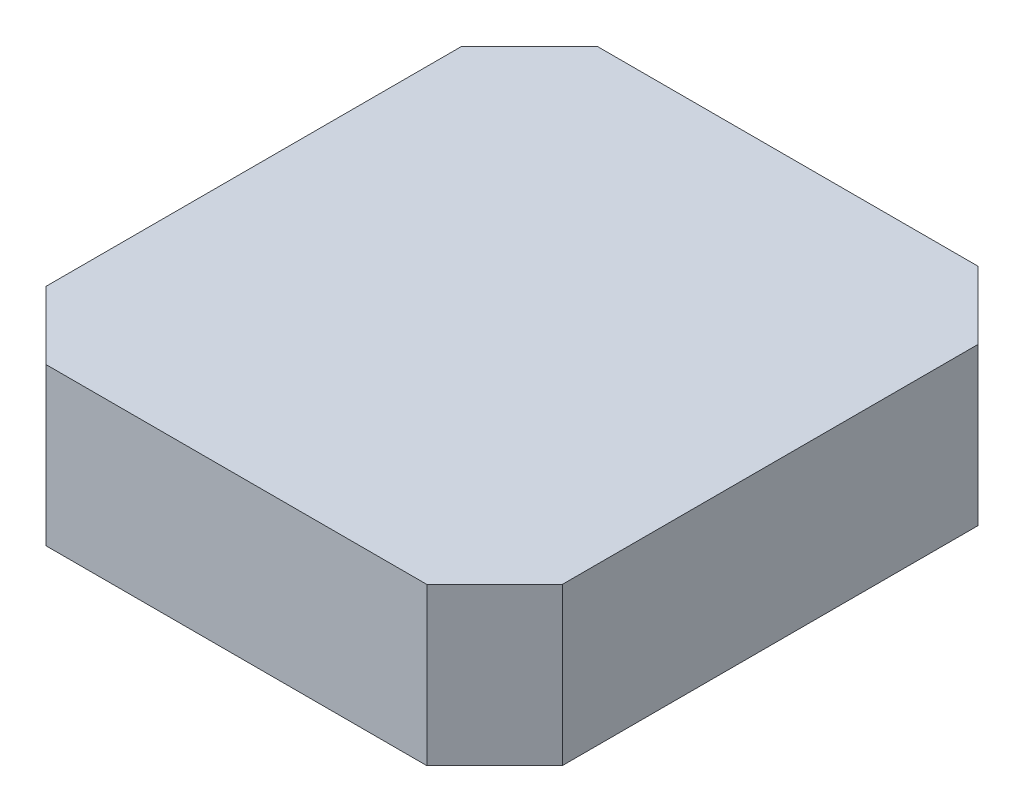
from build123d import *

# Parameters (mm, degrees)
BOSS_EXTRUDE1_DEPTH = 4.5


with BuildPart() as part:
    # Sketch2 → Boss-Extrude1 (new body)
    with BuildSketch(Plane(origin=(0, 0, 0), x_dir=(1, 0, 0), z_dir=(0, 1, 0))):
        Polygon((5.458578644, 7.9), (-5.458578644, 7.9), (-7.4, 5.958578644), (-7.4, -5.958578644), (-5.458578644, -7.9), (5.458578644, -7.9), (7.4, -5.958578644), (7.4, 5.958578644), align=None)
    extrude(amount=BOSS_EXTRUDE1_DEPTH)


solid = part.part
